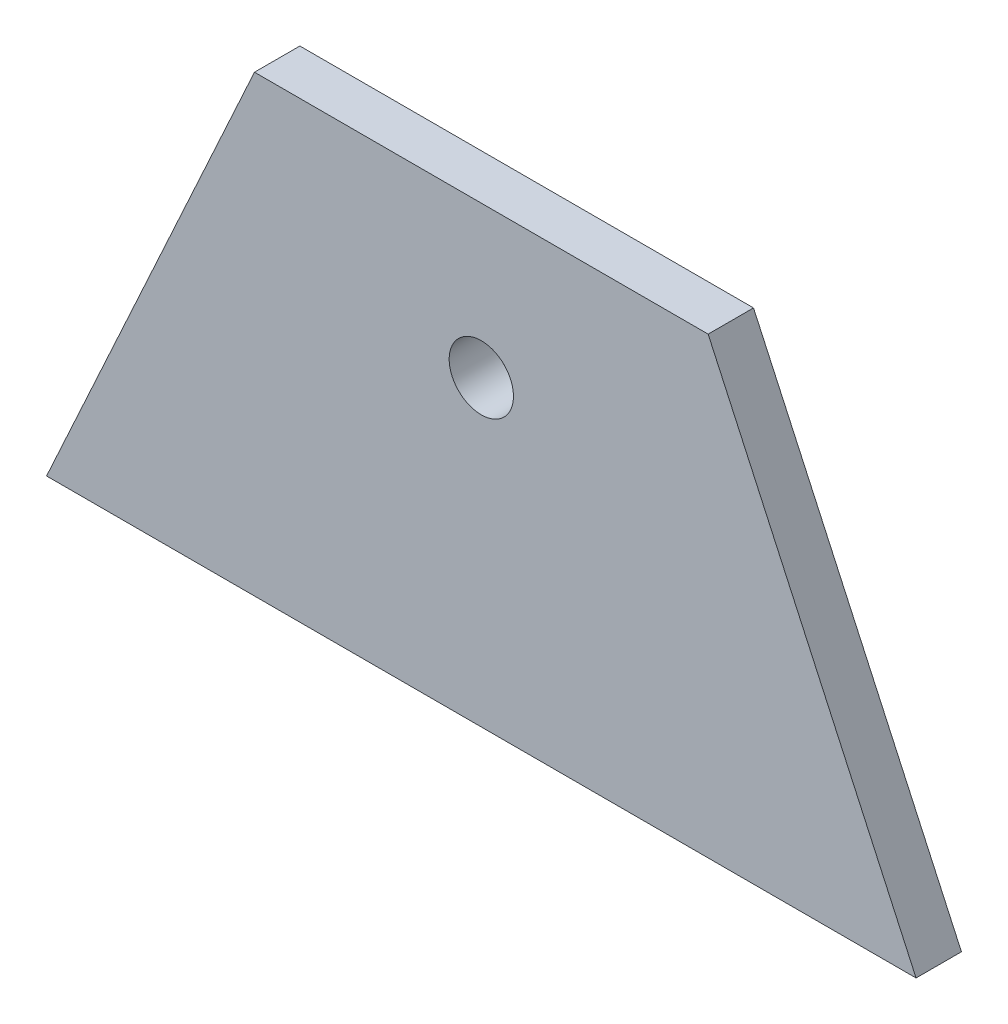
ISO-10303-21;
HEADER;
FILE_DESCRIPTION(('STEP AP214'),'2;1');
FILE_NAME('part.step','',(''),(''),'','','');
FILE_SCHEMA(('AUTOMOTIVE_DESIGN { 1 0 10303 214 1 1 1 1 }'));
ENDSEC;
DATA;
#1=APPLICATION_CONTEXT('core data for automotive mechanical design processes');
#2=APPLICATION_PROTOCOL_DEFINITION('international standard','automotive_design',2000,#1);
#3=PRODUCT_CONTEXT('',#1,'mechanical');
#4=PRODUCT('Part','Part','',(#3));
#5=PRODUCT_RELATED_PRODUCT_CATEGORY('part','',(#4));
#6=PRODUCT_DEFINITION_FORMATION('','',#4);
#7=PRODUCT_DEFINITION_CONTEXT('part definition',#1,'design');
#8=PRODUCT_DEFINITION('design','',#6,#7);
#9=PRODUCT_DEFINITION_SHAPE('','',#8);
#10=(LENGTH_UNIT() NAMED_UNIT(*) SI_UNIT(.MILLI.,.METRE.));
#11=(NAMED_UNIT(*) PLANE_ANGLE_UNIT() SI_UNIT($,.RADIAN.));
#12=(NAMED_UNIT(*) SI_UNIT($,.STERADIAN.) SOLID_ANGLE_UNIT());
#13=UNCERTAINTY_MEASURE_WITH_UNIT(LENGTH_MEASURE(1.E-05),#10,'distance_accuracy_value','');
#14=(GEOMETRIC_REPRESENTATION_CONTEXT(3) GLOBAL_UNCERTAINTY_ASSIGNED_CONTEXT((#13)) GLOBAL_UNIT_ASSIGNED_CONTEXT((#10,
#11,#12)) REPRESENTATION_CONTEXT('',''));
#15=CARTESIAN_POINT('',(0.,0.,0.));
#16=DIRECTION('',(0.,0.,1.));
#17=DIRECTION('',(1.,0.,0.));
#18=AXIS2_PLACEMENT_3D('',#15,#16,#17);
#19=CARTESIAN_POINT('',(0.,0.,12.));
#20=DIRECTION('',(0.,0.,1.));
#21=DIRECTION('',(1.,0.,0.));
#22=AXIS2_PLACEMENT_3D('',#19,#20,#21);
#23=PLANE('',#22);
#24=DIRECTION('',(-0.416654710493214,-0.909064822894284,0.));
#25=VECTOR('',#24,1.);
#26=CARTESIAN_POINT('',(55.,120.,11.9999999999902));
#27=LINE('',#26,#25);
#28=CARTESIAN_POINT('',(55.,120.,11.9999999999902));
#29=VERTEX_POINT('',#28);
#30=CARTESIAN_POINT('',(0.,0.,12.));
#31=VERTEX_POINT('',#30);
#32=EDGE_CURVE('E98',#29,#31,#27,.T.);
#33=ORIENTED_EDGE('',*,*,#32,.T.);
#34=DIRECTION('',(1.,0.,0.));
#35=VECTOR('',#34,1.);
#36=CARTESIAN_POINT('',(0.,0.,12.));
#37=LINE('',#36,#35);
#38=CARTESIAN_POINT('',(230.,0.,11.9999999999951));
#39=VERTEX_POINT('',#38);
#40=EDGE_CURVE('E83',#31,#39,#37,.T.);
#41=ORIENTED_EDGE('',*,*,#40,.T.);
#42=DIRECTION('',(-0.416654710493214,0.909064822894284,0.));
#43=VECTOR('',#42,1.);
#44=CARTESIAN_POINT('',(230.,0.,11.9999999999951));
#45=LINE('',#44,#43);
#46=CARTESIAN_POINT('',(175.,120.,11.9999999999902));
#47=VERTEX_POINT('',#46);
#48=EDGE_CURVE('E49',#39,#47,#45,.T.);
#49=ORIENTED_EDGE('',*,*,#48,.T.);
#50=DIRECTION('',(-1.,0.,0.));
#51=VECTOR('',#50,1.);
#52=CARTESIAN_POINT('',(175.,120.,11.9999999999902));
#53=LINE('',#52,#51);
#54=EDGE_CURVE('E44',#47,#29,#53,.T.);
#55=ORIENTED_EDGE('',*,*,#54,.T.);
#56=EDGE_LOOP('',(#33,#41,#49,#55));
#57=FACE_BOUND('',#56,.T.);
#58=CARTESIAN_POINT('',(114.999999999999,80.,11.9999999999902));
#59=DIRECTION('',(0.,0.,1.));
#60=DIRECTION('',(1.,0.,0.));
#61=AXIS2_PLACEMENT_3D('',#58,#59,#60);
#62=CIRCLE('',#61,8.50000000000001);
#63=CARTESIAN_POINT('',(123.499999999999,80.,11.9999999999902));
#64=VERTEX_POINT('',#63);
#65=EDGE_CURVE('E88',#64,#64,#62,.T.);
#66=ORIENTED_EDGE('',*,*,#65,.F.);
#67=EDGE_LOOP('',(#66));
#68=FACE_BOUND('',#67,.T.);
#69=ADVANCED_FACE('F29',(#57,#68),#23,.T.);
#70=CARTESIAN_POINT('',(0.,0.,0.));
#71=DIRECTION('',(0.,0.,1.));
#72=DIRECTION('',(1.,0.,0.));
#73=AXIS2_PLACEMENT_3D('',#70,#71,#72);
#74=PLANE('',#73);
#75=DIRECTION('',(-0.416654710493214,-0.909064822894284,0.));
#76=VECTOR('',#75,1.);
#77=CARTESIAN_POINT('',(55.,120.,-9.76996261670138E-12));
#78=LINE('',#77,#76);
#79=CARTESIAN_POINT('',(55.,120.,-9.76996261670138E-12));
#80=VERTEX_POINT('',#79);
#81=CARTESIAN_POINT('',(0.,0.,0.));
#82=VERTEX_POINT('',#81);
#83=EDGE_CURVE('E75',#80,#82,#78,.T.);
#84=ORIENTED_EDGE('',*,*,#83,.F.);
#85=DIRECTION('',(-1.,0.,0.));
#86=VECTOR('',#85,1.);
#87=CARTESIAN_POINT('',(175.,120.,-9.76996261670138E-12));
#88=LINE('',#87,#86);
#89=CARTESIAN_POINT('',(175.,120.,-9.76996261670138E-12));
#90=VERTEX_POINT('',#89);
#91=EDGE_CURVE('E96',#90,#80,#88,.T.);
#92=ORIENTED_EDGE('',*,*,#91,.F.);
#93=DIRECTION('',(-0.416654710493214,0.909064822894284,0.));
#94=VECTOR('',#93,1.);
#95=CARTESIAN_POINT('',(230.,0.,-4.88498130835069E-12));
#96=LINE('',#95,#94);
#97=CARTESIAN_POINT('',(230.,0.,-4.88498130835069E-12));
#98=VERTEX_POINT('',#97);
#99=EDGE_CURVE('E76',#98,#90,#96,.T.);
#100=ORIENTED_EDGE('',*,*,#99,.F.);
#101=DIRECTION('',(1.,0.,0.));
#102=VECTOR('',#101,1.);
#103=CARTESIAN_POINT('',(0.,0.,0.));
#104=LINE('',#103,#102);
#105=EDGE_CURVE('E70',#82,#98,#104,.T.);
#106=ORIENTED_EDGE('',*,*,#105,.F.);
#107=EDGE_LOOP('',(#84,#92,#100,#106));
#108=FACE_BOUND('',#107,.T.);
#109=CARTESIAN_POINT('',(114.999999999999,80.,-9.76996261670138E-12));
#110=DIRECTION('',(0.,0.,1.));
#111=DIRECTION('',(1.,0.,0.));
#112=AXIS2_PLACEMENT_3D('',#109,#110,#111);
#113=CIRCLE('',#112,8.50000000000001);
#114=CARTESIAN_POINT('',(123.499999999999,80.,-9.76996261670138E-12));
#115=VERTEX_POINT('',#114);
#116=EDGE_CURVE('E91',#115,#115,#113,.T.);
#117=ORIENTED_EDGE('',*,*,#116,.T.);
#118=EDGE_LOOP('',(#117));
#119=FACE_BOUND('',#118,.T.);
#120=ADVANCED_FACE('F71',(#108,#119),#74,.F.);
#121=CARTESIAN_POINT('',(55.,120.,11.9999999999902));
#122=DIRECTION('',(0.909064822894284,-0.416654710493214,0.));
#123=DIRECTION('',(0.416654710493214,0.909064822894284,0.));
#124=AXIS2_PLACEMENT_3D('',#121,#122,#123);
#125=PLANE('',#124);
#126=ORIENTED_EDGE('',*,*,#83,.T.);
#127=DIRECTION('',(0.,0.,-1.));
#128=VECTOR('',#127,1.);
#129=CARTESIAN_POINT('',(0.,0.,12.));
#130=LINE('',#129,#128);
#131=EDGE_CURVE('E11',#31,#82,#130,.T.);
#132=ORIENTED_EDGE('',*,*,#131,.F.);
#133=ORIENTED_EDGE('',*,*,#32,.F.);
#134=DIRECTION('',(0.,0.,-1.));
#135=VECTOR('',#134,1.);
#136=CARTESIAN_POINT('',(55.,120.,11.9999999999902));
#137=LINE('',#136,#135);
#138=EDGE_CURVE('E87',#29,#80,#137,.T.);
#139=ORIENTED_EDGE('',*,*,#138,.T.);
#140=EDGE_LOOP('',(#126,#132,#133,#139));
#141=FACE_BOUND('',#140,.T.);
#142=ADVANCED_FACE('F31',(#141),#125,.F.);
#143=CARTESIAN_POINT('',(0.,0.,12.));
#144=DIRECTION('',(0.,1.,0.));
#145=DIRECTION('',(0.,0.,1.));
#146=AXIS2_PLACEMENT_3D('',#143,#144,#145);
#147=PLANE('',#146);
#148=ORIENTED_EDGE('',*,*,#105,.T.);
#149=DIRECTION('',(0.,0.,-1.));
#150=VECTOR('',#149,1.);
#151=CARTESIAN_POINT('',(230.,0.,11.9999999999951));
#152=LINE('',#151,#150);
#153=EDGE_CURVE('E37',#39,#98,#152,.T.);
#154=ORIENTED_EDGE('',*,*,#153,.F.);
#155=ORIENTED_EDGE('',*,*,#40,.F.);
#156=ORIENTED_EDGE('',*,*,#131,.T.);
#157=EDGE_LOOP('',(#148,#154,#155,#156));
#158=FACE_BOUND('',#157,.T.);
#159=ADVANCED_FACE('F82',(#158),#147,.F.);
#160=CARTESIAN_POINT('',(230.,0.,11.9999999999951));
#161=DIRECTION('',(-0.909064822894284,-0.416654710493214,0.));
#162=DIRECTION('',(0.416654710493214,-0.909064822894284,0.));
#163=AXIS2_PLACEMENT_3D('',#160,#161,#162);
#164=PLANE('',#163);
#165=ORIENTED_EDGE('',*,*,#99,.T.);
#166=DIRECTION('',(0.,0.,-1.));
#167=VECTOR('',#166,1.);
#168=CARTESIAN_POINT('',(175.,120.,11.9999999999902));
#169=LINE('',#168,#167);
#170=EDGE_CURVE('E104',#47,#90,#169,.T.);
#171=ORIENTED_EDGE('',*,*,#170,.F.);
#172=ORIENTED_EDGE('',*,*,#48,.F.);
#173=ORIENTED_EDGE('',*,*,#153,.T.);
#174=EDGE_LOOP('',(#165,#171,#172,#173));
#175=FACE_BOUND('',#174,.T.);
#176=ADVANCED_FACE('F107',(#175),#164,.F.);
#177=CARTESIAN_POINT('',(175.,120.,11.9999999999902));
#178=DIRECTION('',(0.,-1.,0.));
#179=DIRECTION('',(1.,0.,0.));
#180=AXIS2_PLACEMENT_3D('',#177,#178,#179);
#181=PLANE('',#180);
#182=ORIENTED_EDGE('',*,*,#91,.T.);
#183=ORIENTED_EDGE('',*,*,#138,.F.);
#184=ORIENTED_EDGE('',*,*,#54,.F.);
#185=ORIENTED_EDGE('',*,*,#170,.T.);
#186=EDGE_LOOP('',(#182,#183,#184,#185));
#187=FACE_BOUND('',#186,.T.);
#188=ADVANCED_FACE('F109',(#187),#181,.F.);
#189=CARTESIAN_POINT('',(114.999999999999,80.,11.9999999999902));
#190=DIRECTION('',(0.,0.,-1.));
#191=DIRECTION('',(-1.,0.,0.));
#192=AXIS2_PLACEMENT_3D('',#189,#190,#191);
#193=CYLINDRICAL_SURFACE('',#192,8.50000000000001);
#194=ORIENTED_EDGE('',*,*,#65,.T.);
#195=EDGE_LOOP('',(#194));
#196=FACE_BOUND('',#195,.T.);
#197=ORIENTED_EDGE('',*,*,#116,.F.);
#198=EDGE_LOOP('',(#197));
#199=FACE_BOUND('',#198,.T.);
#200=ADVANCED_FACE('F115',(#196,#199),#193,.F.);
#201=CLOSED_SHELL('',(#69,#120,#142,#159,#176,#188,#200));
#202=MANIFOLD_SOLID_BREP('B2',#201);
#203=ADVANCED_BREP_SHAPE_REPRESENTATION('',(#18,#202),#14);
#204=SHAPE_DEFINITION_REPRESENTATION(#9,#203);
ENDSEC;
END-ISO-10303-21;
